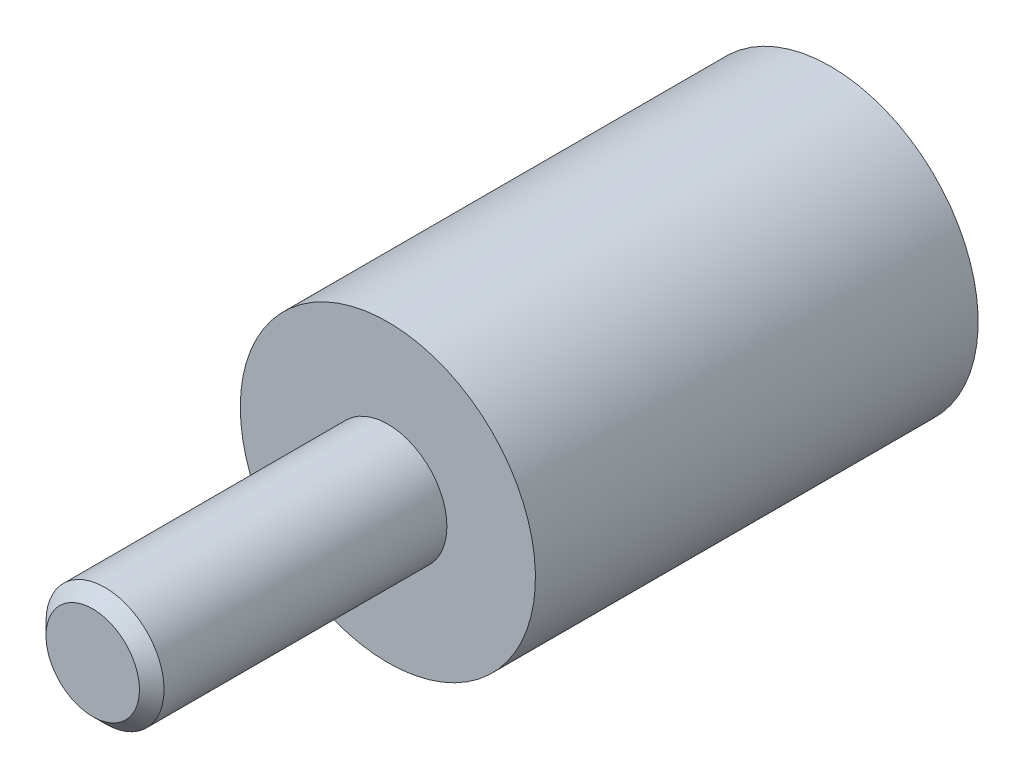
ISO-10303-21;
HEADER;
FILE_DESCRIPTION(('STEP AP214'),'2;1');
FILE_NAME('part.step','',(''),(''),'','','');
FILE_SCHEMA(('AUTOMOTIVE_DESIGN { 1 0 10303 214 1 1 1 1 }'));
ENDSEC;
DATA;
#1=APPLICATION_CONTEXT('core data for automotive mechanical design processes');
#2=APPLICATION_PROTOCOL_DEFINITION('international standard','automotive_design',2000,#1);
#3=PRODUCT_CONTEXT('',#1,'mechanical');
#4=PRODUCT('Part','Part','',(#3));
#5=PRODUCT_RELATED_PRODUCT_CATEGORY('part','',(#4));
#6=PRODUCT_DEFINITION_FORMATION('','',#4);
#7=PRODUCT_DEFINITION_CONTEXT('part definition',#1,'design');
#8=PRODUCT_DEFINITION('design','',#6,#7);
#9=PRODUCT_DEFINITION_SHAPE('','',#8);
#10=(LENGTH_UNIT() NAMED_UNIT(*) SI_UNIT(.MILLI.,.METRE.));
#11=(NAMED_UNIT(*) PLANE_ANGLE_UNIT() SI_UNIT($,.RADIAN.));
#12=(NAMED_UNIT(*) SI_UNIT($,.STERADIAN.) SOLID_ANGLE_UNIT());
#13=UNCERTAINTY_MEASURE_WITH_UNIT(LENGTH_MEASURE(1.E-05),#10,'distance_accuracy_value','');
#14=(GEOMETRIC_REPRESENTATION_CONTEXT(3) GLOBAL_UNCERTAINTY_ASSIGNED_CONTEXT((#13)) GLOBAL_UNIT_ASSIGNED_CONTEXT((#10,
#11,#12)) REPRESENTATION_CONTEXT('',''));
#15=CARTESIAN_POINT('',(0.,0.,0.));
#16=DIRECTION('',(0.,0.,1.));
#17=DIRECTION('',(1.,0.,0.));
#18=AXIS2_PLACEMENT_3D('',#15,#16,#17);
#19=CARTESIAN_POINT('',(0.,0.,0.33333333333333));
#20=DIRECTION('',(0.,0.,1.));
#21=DIRECTION('',(0.,-1.,0.));
#22=AXIS2_PLACEMENT_3D('',#19,#20,#21);
#23=CYLINDRICAL_SURFACE('',#22,5.);
#24=CARTESIAN_POINT('',(0.,0.,0.));
#25=DIRECTION('',(0.,0.,1.));
#26=DIRECTION('',(0.,-1.,0.));
#27=AXIS2_PLACEMENT_3D('',#24,#25,#26);
#28=CIRCLE('',#27,5.);
#29=CARTESIAN_POINT('',(0.,-5.,0.));
#30=VERTEX_POINT('',#29);
#31=EDGE_CURVE('E27',#30,#30,#28,.T.);
#32=ORIENTED_EDGE('',*,*,#31,.T.);
#33=EDGE_LOOP('',(#32));
#34=FACE_BOUND('',#33,.T.);
#35=CARTESIAN_POINT('',(0.,0.,15.));
#36=DIRECTION('',(0.,0.,-1.));
#37=DIRECTION('',(-1.,0.,0.));
#38=AXIS2_PLACEMENT_3D('',#35,#36,#37);
#39=CIRCLE('',#38,5.);
#40=CARTESIAN_POINT('',(-5.,0.,15.));
#41=VERTEX_POINT('',#40);
#42=EDGE_CURVE('E35',#41,#41,#39,.T.);
#43=ORIENTED_EDGE('',*,*,#42,.T.);
#44=EDGE_LOOP('',(#43));
#45=FACE_BOUND('',#44,.T.);
#46=ADVANCED_FACE('F12',(#34,#45),#23,.T.);
#47=CARTESIAN_POINT('',(5.,0.,0.));
#48=DIRECTION('',(0.,0.,-1.));
#49=DIRECTION('',(0.,1.,0.));
#50=AXIS2_PLACEMENT_3D('',#47,#48,#49);
#51=PLANE('',#50);
#52=CARTESIAN_POINT('',(0.,0.,0.));
#53=DIRECTION('',(0.,0.,-1.));
#54=DIRECTION('',(0.,1.,0.));
#55=AXIS2_PLACEMENT_3D('',#52,#53,#54);
#56=CIRCLE('',#55,2.4);
#57=CARTESIAN_POINT('',(0.,2.4,0.));
#58=VERTEX_POINT('',#57);
#59=EDGE_CURVE('E19',#58,#58,#56,.F.);
#60=ORIENTED_EDGE('',*,*,#59,.T.);
#61=EDGE_LOOP('',(#60));
#62=FACE_BOUND('',#61,.T.);
#63=ORIENTED_EDGE('',*,*,#31,.F.);
#64=EDGE_LOOP('',(#63));
#65=FACE_BOUND('',#64,.T.);
#66=ADVANCED_FACE('F58',(#62,#65),#51,.T.);
#67=CARTESIAN_POINT('',(0.,0.,0.));
#68=DIRECTION('',(0.,0.,1.));
#69=DIRECTION('',(0.,-1.,0.));
#70=AXIS2_PLACEMENT_3D('',#67,#68,#69);
#71=CYLINDRICAL_SURFACE('',#70,2.);
#72=CARTESIAN_POINT('',(0.,0.,0.399999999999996));
#73=DIRECTION('',(0.,0.,-1.));
#74=DIRECTION('',(0.,1.,0.));
#75=AXIS2_PLACEMENT_3D('',#72,#73,#74);
#76=CIRCLE('',#75,2.);
#77=CARTESIAN_POINT('',(0.,2.,0.399999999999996));
#78=VERTEX_POINT('',#77);
#79=EDGE_CURVE('E23',#78,#78,#76,.T.);
#80=ORIENTED_EDGE('',*,*,#79,.T.);
#81=EDGE_LOOP('',(#80));
#82=FACE_BOUND('',#81,.T.);
#83=CARTESIAN_POINT('',(0.,0.,4.));
#84=DIRECTION('',(0.,0.,-1.));
#85=DIRECTION('',(0.,1.,0.));
#86=AXIS2_PLACEMENT_3D('',#83,#84,#85);
#87=CIRCLE('',#86,2.);
#88=CARTESIAN_POINT('',(0.,2.,4.));
#89=VERTEX_POINT('',#88);
#90=EDGE_CURVE('E32',#89,#89,#87,.T.);
#91=ORIENTED_EDGE('',*,*,#90,.F.);
#92=EDGE_LOOP('',(#91));
#93=FACE_BOUND('',#92,.T.);
#94=ADVANCED_FACE('F63',(#82,#93),#71,.F.);
#95=CARTESIAN_POINT('',(0.,0.,4.));
#96=DIRECTION('',(0.,0.,-1.));
#97=DIRECTION('',(0.,1.,0.));
#98=AXIS2_PLACEMENT_3D('',#95,#96,#97);
#99=PLANE('',#98);
#100=ORIENTED_EDGE('',*,*,#90,.T.);
#101=EDGE_LOOP('',(#100));
#102=FACE_BOUND('',#101,.T.);
#103=ADVANCED_FACE('F69',(#102),#99,.T.);
#104=CARTESIAN_POINT('',(0.,0.,0.399999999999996));
#105=DIRECTION('',(0.,0.,-1.));
#106=DIRECTION('',(0.,1.,0.));
#107=AXIS2_PLACEMENT_3D('',#104,#105,#106);
#108=CONICAL_SURFACE('',#107,2.,0.785398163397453);
#109=ORIENTED_EDGE('',*,*,#59,.F.);
#110=EDGE_LOOP('',(#109));
#111=FACE_BOUND('',#110,.T.);
#112=ORIENTED_EDGE('',*,*,#79,.F.);
#113=EDGE_LOOP('',(#112));
#114=FACE_BOUND('',#113,.T.);
#115=ADVANCED_FACE('F14',(#111,#114),#108,.F.);
#116=CARTESIAN_POINT('',(0.,5.,15.));
#117=DIRECTION('',(0.,0.,1.));
#118=DIRECTION('',(1.,0.,0.));
#119=AXIS2_PLACEMENT_3D('',#116,#117,#118);
#120=PLANE('',#119);
#121=CARTESIAN_POINT('',(0.,0.,15.));
#122=DIRECTION('',(0.,0.,1.));
#123=DIRECTION('',(1.,0.,0.));
#124=AXIS2_PLACEMENT_3D('',#121,#122,#123);
#125=CIRCLE('',#124,2.);
#126=CARTESIAN_POINT('',(2.,0.,15.));
#127=VERTEX_POINT('',#126);
#128=EDGE_CURVE('E8',#127,#127,#125,.F.);
#129=ORIENTED_EDGE('',*,*,#128,.T.);
#130=EDGE_LOOP('',(#129));
#131=FACE_BOUND('',#130,.T.);
#132=ORIENTED_EDGE('',*,*,#42,.F.);
#133=EDGE_LOOP('',(#132));
#134=FACE_BOUND('',#133,.T.);
#135=ADVANCED_FACE('F73',(#131,#134),#120,.T.);
#136=CARTESIAN_POINT('',(0.,0.,10.));
#137=DIRECTION('',(0.,0.,1.));
#138=DIRECTION('',(0.,-1.,0.));
#139=AXIS2_PLACEMENT_3D('',#136,#137,#138);
#140=CYLINDRICAL_SURFACE('',#139,2.);
#141=ORIENTED_EDGE('',*,*,#128,.F.);
#142=EDGE_LOOP('',(#141));
#143=FACE_BOUND('',#142,.T.);
#144=CARTESIAN_POINT('',(0.,0.,24.5824142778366));
#145=DIRECTION('',(0.,0.,-1.));
#146=DIRECTION('',(-1.,0.,0.));
#147=AXIS2_PLACEMENT_3D('',#144,#145,#146);
#148=CIRCLE('',#147,2.);
#149=CARTESIAN_POINT('',(-2.,0.,24.5824142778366));
#150=VERTEX_POINT('',#149);
#151=EDGE_CURVE('E38',#150,#150,#148,.T.);
#152=ORIENTED_EDGE('',*,*,#151,.T.);
#153=EDGE_LOOP('',(#152));
#154=FACE_BOUND('',#153,.T.);
#155=ADVANCED_FACE('F55',(#143,#154),#140,.T.);
#156=CARTESIAN_POINT('',(0.,0.,24.5824142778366));
#157=DIRECTION('',(0.,0.,-1.));
#158=DIRECTION('',(-1.,0.,0.));
#159=AXIS2_PLACEMENT_3D('',#156,#157,#158);
#160=CONICAL_SURFACE('',#159,2.,0.785398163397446);
#161=CARTESIAN_POINT('',(0.,0.,25.));
#162=DIRECTION('',(0.,0.,-1.));
#163=DIRECTION('',(-1.,0.,0.));
#164=AXIS2_PLACEMENT_3D('',#161,#162,#163);
#165=CIRCLE('',#164,1.58241427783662);
#166=CARTESIAN_POINT('',(-1.58241427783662,0.,25.));
#167=VERTEX_POINT('',#166);
#168=EDGE_CURVE('E41',#167,#167,#165,.T.);
#169=ORIENTED_EDGE('',*,*,#168,.T.);
#170=EDGE_LOOP('',(#169));
#171=FACE_BOUND('',#170,.T.);
#172=ORIENTED_EDGE('',*,*,#151,.F.);
#173=EDGE_LOOP('',(#172));
#174=FACE_BOUND('',#173,.T.);
#175=ADVANCED_FACE('F45',(#171,#174),#160,.T.);
#176=CARTESIAN_POINT('',(0.,1.58241427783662,25.));
#177=DIRECTION('',(0.,0.,1.));
#178=DIRECTION('',(1.,0.,0.));
#179=AXIS2_PLACEMENT_3D('',#176,#177,#178);
#180=PLANE('',#179);
#181=ORIENTED_EDGE('',*,*,#168,.F.);
#182=EDGE_LOOP('',(#181));
#183=FACE_BOUND('',#182,.T.);
#184=ADVANCED_FACE('F48',(#183),#180,.T.);
#185=CLOSED_SHELL('',(#46,#66,#94,#103,#115,#135,#155,#175,#184));
#186=MANIFOLD_SOLID_BREP('B1',#185);
#187=ADVANCED_BREP_SHAPE_REPRESENTATION('',(#18,#186),#14);
#188=SHAPE_DEFINITION_REPRESENTATION(#9,#187);
ENDSEC;
END-ISO-10303-21;
